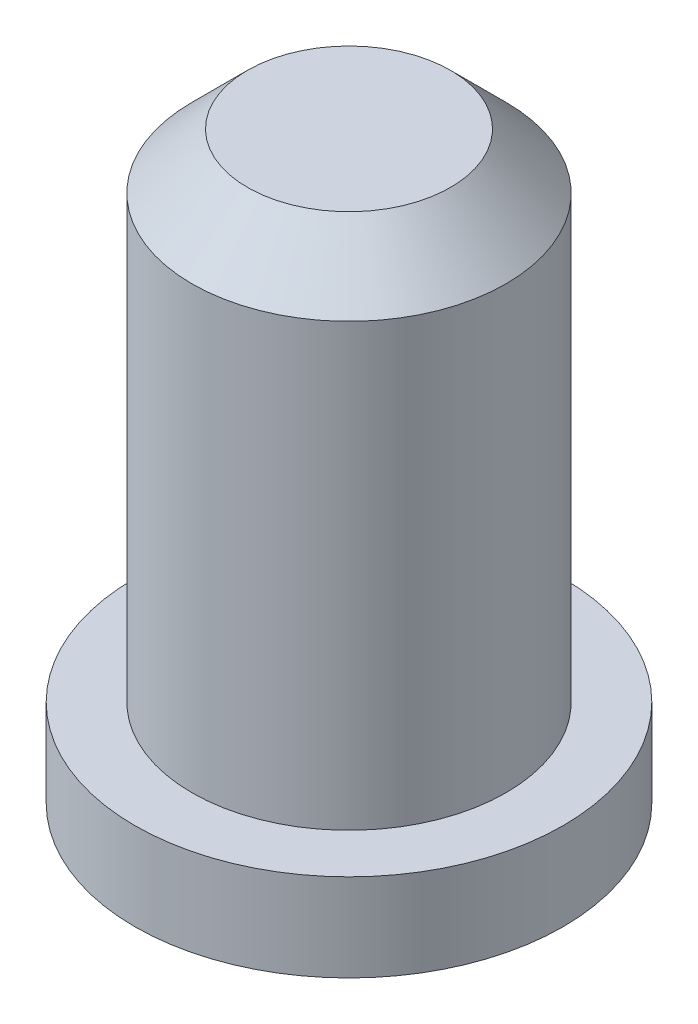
ISO-10303-21;
HEADER;
FILE_DESCRIPTION(('STEP AP214'),'2;1');
FILE_NAME('part.step','',(''),(''),'','','');
FILE_SCHEMA(('AUTOMOTIVE_DESIGN { 1 0 10303 214 1 1 1 1 }'));
ENDSEC;
DATA;
#1=APPLICATION_CONTEXT('core data for automotive mechanical design processes');
#2=APPLICATION_PROTOCOL_DEFINITION('international standard','automotive_design',2000,#1);
#3=PRODUCT_CONTEXT('',#1,'mechanical');
#4=PRODUCT('Part','Part','',(#3));
#5=PRODUCT_RELATED_PRODUCT_CATEGORY('part','',(#4));
#6=PRODUCT_DEFINITION_FORMATION('','',#4);
#7=PRODUCT_DEFINITION_CONTEXT('part definition',#1,'design');
#8=PRODUCT_DEFINITION('design','',#6,#7);
#9=PRODUCT_DEFINITION_SHAPE('','',#8);
#10=(LENGTH_UNIT() NAMED_UNIT(*) SI_UNIT(.MILLI.,.METRE.));
#11=(NAMED_UNIT(*) PLANE_ANGLE_UNIT() SI_UNIT($,.RADIAN.));
#12=(NAMED_UNIT(*) SI_UNIT($,.STERADIAN.) SOLID_ANGLE_UNIT());
#13=UNCERTAINTY_MEASURE_WITH_UNIT(LENGTH_MEASURE(1.E-05),#10,'distance_accuracy_value','');
#14=(GEOMETRIC_REPRESENTATION_CONTEXT(3) GLOBAL_UNCERTAINTY_ASSIGNED_CONTEXT((#13)) GLOBAL_UNIT_ASSIGNED_CONTEXT((#10,
#11,#12)) REPRESENTATION_CONTEXT('',''));
#15=CARTESIAN_POINT('',(0.,0.,0.));
#16=DIRECTION('',(0.,0.,1.));
#17=DIRECTION('',(1.,0.,0.));
#18=AXIS2_PLACEMENT_3D('',#15,#16,#17);
#19=CARTESIAN_POINT('',(0.,0.,0.));
#20=DIRECTION('',(0.,1.,0.));
#21=DIRECTION('',(-1.,0.,0.));
#22=AXIS2_PLACEMENT_3D('',#19,#20,#21);
#23=PLANE('',#22);
#24=CARTESIAN_POINT('',(0.,0.,0.));
#25=DIRECTION('',(0.,1.,0.));
#26=DIRECTION('',(-1.,0.,0.));
#27=AXIS2_PLACEMENT_3D('',#24,#25,#26);
#28=CIRCLE('',#27,1.9558);
#29=CARTESIAN_POINT('',(-1.9558,0.,0.));
#30=VERTEX_POINT('',#29);
#31=EDGE_CURVE('E10',#30,#30,#28,.T.);
#32=ORIENTED_EDGE('',*,*,#31,.F.);
#33=EDGE_LOOP('',(#32));
#34=FACE_BOUND('',#33,.T.);
#35=ADVANCED_FACE('F32',(#34),#23,.F.);
#36=CARTESIAN_POINT('',(0.,2.667,0.));
#37=DIRECTION('',(0.,1.,0.));
#38=DIRECTION('',(-1.,0.,0.));
#39=AXIS2_PLACEMENT_3D('',#36,#37,#38);
#40=CYLINDRICAL_SURFACE('',#39,1.9558);
#41=CARTESIAN_POINT('',(0.,0.8001,0.));
#42=DIRECTION('',(0.,1.,0.));
#43=DIRECTION('',(-1.,0.,0.));
#44=AXIS2_PLACEMENT_3D('',#41,#42,#43);
#45=CIRCLE('',#44,1.9558);
#46=CARTESIAN_POINT('',(-1.9558,0.8001,0.));
#47=VERTEX_POINT('',#46);
#48=EDGE_CURVE('E38',#47,#47,#45,.T.);
#49=ORIENTED_EDGE('',*,*,#48,.F.);
#50=EDGE_LOOP('',(#49));
#51=FACE_BOUND('',#50,.T.);
#52=ORIENTED_EDGE('',*,*,#31,.T.);
#53=EDGE_LOOP('',(#52));
#54=FACE_BOUND('',#53,.T.);
#55=ADVANCED_FACE('F71',(#51,#54),#40,.T.);
#56=CARTESIAN_POINT('',(1.9558,0.8001,0.));
#57=DIRECTION('',(0.,-1.,0.));
#58=DIRECTION('',(1.,0.,0.));
#59=AXIS2_PLACEMENT_3D('',#56,#57,#58);
#60=PLANE('',#59);
#61=CARTESIAN_POINT('',(0.,0.800099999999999,0.));
#62=DIRECTION('',(0.,1.,0.));
#63=DIRECTION('',(-1.,0.,0.));
#64=AXIS2_PLACEMENT_3D('',#61,#62,#63);
#65=CIRCLE('',#64,1.4351);
#66=CARTESIAN_POINT('',(-1.4351,0.800099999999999,0.));
#67=VERTEX_POINT('',#66);
#68=EDGE_CURVE('E42',#67,#67,#65,.T.);
#69=ORIENTED_EDGE('',*,*,#68,.F.);
#70=EDGE_LOOP('',(#69));
#71=FACE_BOUND('',#70,.T.);
#72=ORIENTED_EDGE('',*,*,#48,.T.);
#73=EDGE_LOOP('',(#72));
#74=FACE_BOUND('',#73,.T.);
#75=ADVANCED_FACE('F66',(#71,#74),#60,.F.);
#76=CARTESIAN_POINT('',(0.,2.667,0.));
#77=DIRECTION('',(0.,1.,0.));
#78=DIRECTION('',(-1.,0.,0.));
#79=AXIS2_PLACEMENT_3D('',#76,#77,#78);
#80=CYLINDRICAL_SURFACE('',#79,1.4351);
#81=CARTESIAN_POINT('',(0.,4.826,0.));
#82=DIRECTION('',(0.,1.,0.));
#83=DIRECTION('',(-1.,0.,0.));
#84=AXIS2_PLACEMENT_3D('',#81,#82,#83);
#85=CIRCLE('',#84,1.4351);
#86=CARTESIAN_POINT('',(-1.4351,4.826,0.));
#87=VERTEX_POINT('',#86);
#88=EDGE_CURVE('E46',#87,#87,#85,.T.);
#89=ORIENTED_EDGE('',*,*,#88,.F.);
#90=EDGE_LOOP('',(#89));
#91=FACE_BOUND('',#90,.T.);
#92=ORIENTED_EDGE('',*,*,#68,.T.);
#93=EDGE_LOOP('',(#92));
#94=FACE_BOUND('',#93,.T.);
#95=ADVANCED_FACE('F60',(#91,#94),#80,.T.);
#96=CARTESIAN_POINT('',(0.,4.826,0.));
#97=DIRECTION('',(0.,-1.,0.));
#98=DIRECTION('',(1.,0.,0.));
#99=AXIS2_PLACEMENT_3D('',#96,#97,#98);
#100=CONICAL_SURFACE('',#99,1.4351,0.785398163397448);
#101=CARTESIAN_POINT('',(0.,5.334,0.));
#102=DIRECTION('',(0.,1.,0.));
#103=DIRECTION('',(-1.,0.,0.));
#104=AXIS2_PLACEMENT_3D('',#101,#102,#103);
#105=CIRCLE('',#104,0.9271);
#106=CARTESIAN_POINT('',(-0.927099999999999,5.334,0.));
#107=VERTEX_POINT('',#106);
#108=EDGE_CURVE('E51',#107,#107,#105,.T.);
#109=ORIENTED_EDGE('',*,*,#108,.F.);
#110=EDGE_LOOP('',(#109));
#111=FACE_BOUND('',#110,.T.);
#112=ORIENTED_EDGE('',*,*,#88,.T.);
#113=EDGE_LOOP('',(#112));
#114=FACE_BOUND('',#113,.T.);
#115=ADVANCED_FACE('F57',(#111,#114),#100,.T.);
#116=CARTESIAN_POINT('',(0.9271,5.334,0.));
#117=DIRECTION('',(0.,-1.,0.));
#118=DIRECTION('',(1.,0.,0.));
#119=AXIS2_PLACEMENT_3D('',#116,#117,#118);
#120=PLANE('',#119);
#121=ORIENTED_EDGE('',*,*,#108,.T.);
#122=EDGE_LOOP('',(#121));
#123=FACE_BOUND('',#122,.T.);
#124=ADVANCED_FACE('F55',(#123),#120,.F.);
#125=CLOSED_SHELL('',(#35,#55,#75,#95,#115,#124));
#126=MANIFOLD_SOLID_BREP('B2',#125);
#127=ADVANCED_BREP_SHAPE_REPRESENTATION('',(#18,#126),#14);
#128=SHAPE_DEFINITION_REPRESENTATION(#9,#127);
ENDSEC;
END-ISO-10303-21;
